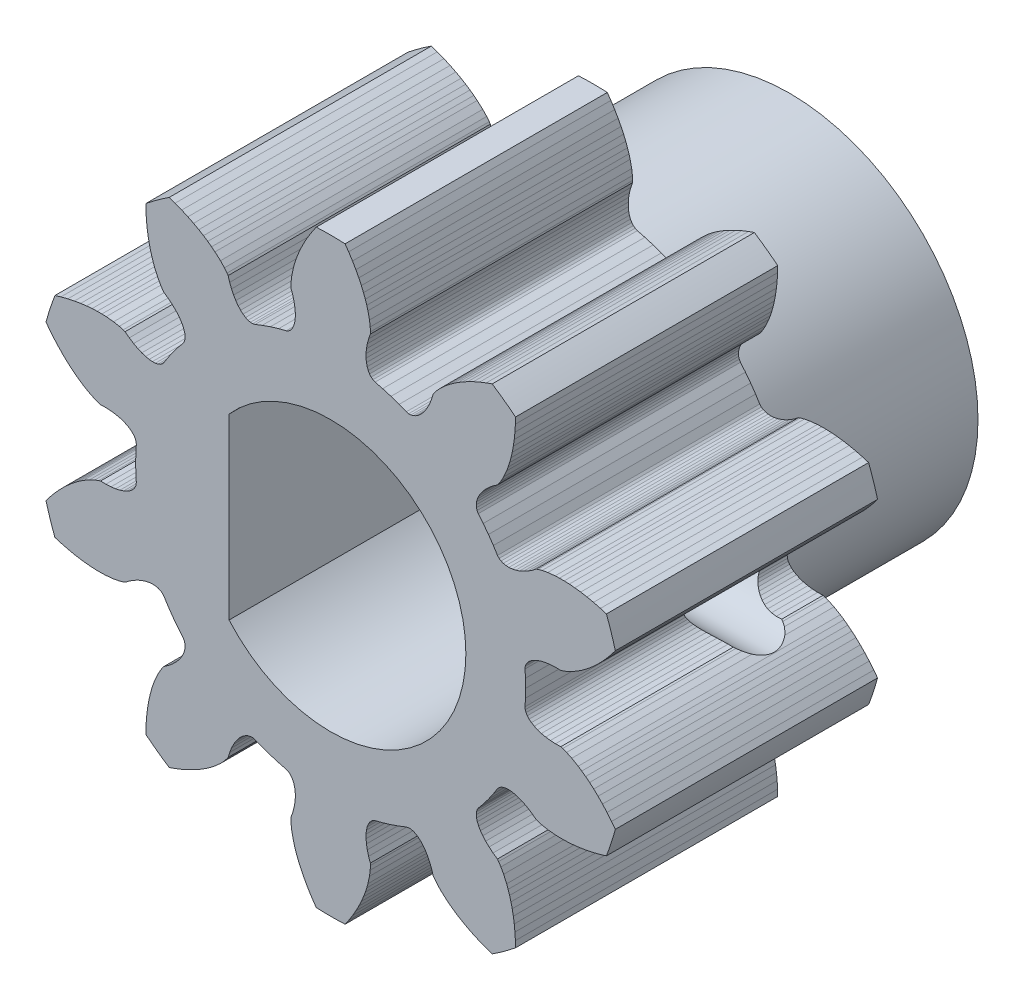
from build123d import *

# Parameters (mm, degrees)
ESTRUSIONE_ESTRUSIONE1_DEPTH  = 8
SCHIZZO3_R                    = 5.75
ESTRUSIONE_ESTRUSIONE2_DEPTH  = 6
TAGLIO_ESTRUSIONE1_DEPTH      = 101.078894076
TAGLIO_ESTRUSIONE2_DEPTH      = 17.849096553
TAGLIO_ESTRUSIONE2_DEPTH_BACK = 17.849096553
SCHIZZO5_R                    = 1.25


with BuildPart() as part:
    # Model → Estrusione-Estrusione1 (new body)
    with BuildSketch(Plane.XY):
        with BuildLine():
            Line((84.3642531, -6.8229085), (84.3776998, -6.6052075))
            Line((84.3776998, -6.6052075), (84.3989533, -6.4006846))
            Line((84.3989533, -6.4006846), (84.4270013, -6.2092224))
            Line((84.4270013, -6.2092224), (84.4608808, -6.0306182))
            Line((84.4608808, -6.0306182), (84.4990231, -5.8672724))
            Line((84.4990231, -5.8672724), (84.5406755, -5.7173835))
            Line((84.5406755, -5.7173835), (84.5852556, -5.5796565))
            Line((84.5852556, -5.5796565), (84.6311311, -5.4559447))
            Line((84.6311311, -5.4559447), (84.7223454, -5.2499237))
            Line((84.7223454, -5.2499237), (84.8060545, -5.0966229))
            Line((84.8060545, -5.0966229), (84.8758535, -4.9906464))
            Line((84.8758535, -4.9906464), (84.9126878, -4.9426861))
            Line((84.9126878, -4.9426861), (85.0452767, -4.8498404))
            Line((85.0452767, -4.8498404), (85.1666403, -4.7509355))
            Line((85.1666403, -4.7509355), (85.2711871, -4.6508992))
            Line((85.2711871, -4.6508992), (85.3590444, -4.5509615))
            Line((85.3590444, -4.5509615), (85.4304419, -4.4523401))
            Line((85.4304419, -4.4523401), (85.4856415, -4.3562291))
            Line((85.4856415, -4.3562291), (85.5250211, -4.2638123))
            Line((85.5250211, -4.2638123), (85.5489897, -4.1762141))
            Line((85.5489897, -4.1762141), (85.5580542, -4.0945743))
            Line((85.5580542, -4.0945743), (85.5527684, -4.0199615))
            Line((85.5527684, -4.0199615), (85.5337603, -3.9534272))
            Line((85.5337603, -3.9534272), (85.4968309, -3.8894812))
            Line((85.4968309, -3.8894812), (85.3459564, -3.7071016))
            Line((85.3459564, -3.7071016), (85.1863489, -3.4973223))
            Line((85.1863489, -3.4973223), (85.0361583, -3.2807011))
            Line((85.0361583, -3.2807011), (84.9093278, -3.0808525))
            Line((84.9093278, -3.0808525), (84.8599233, -3.0259701))
            Line((84.8599233, -3.0259701), (84.8025193, -2.9873322))
            Line((84.8025193, -2.9873322), (84.7331917, -2.9592484))
            Line((84.7331917, -2.9592484), (84.6527465, -2.9426412))
            Line((84.6527465, -2.9426412), (84.562029, -2.9383674))
            Line((84.562029, -2.9383674), (84.4619664, -2.9472613))
            Line((84.4619664, -2.9472613), (84.3535018, -2.9700592))
            Line((84.3535018, -2.9700592), (84.2376442, -3.0074866))
            Line((84.2376442, -3.0074866), (84.1154484, -3.0601615))
            Line((84.1154484, -3.0601615), (83.9880015, -3.1286785))
            Line((83.9880015, -3.1286785), (83.856434, -3.2135388))
            Line((83.856434, -3.2135388), (83.7271602, -3.3109474))
            Line((83.7271602, -3.3109474), (83.6701648, -3.3311584))
            Line((83.6701648, -3.3311584), (83.5478061, -3.3647926))
            Line((83.5478061, -3.3647926), (83.3761409, -3.3970321))
            Line((83.3761409, -3.3970321), (83.1520165, -3.4201181))
            Line((83.1520165, -3.4201181), (83.0201833, -3.4255193))
            Line((83.0201833, -3.4255193), (82.8754211, -3.4253575))
            Line((82.8754211, -3.4253575), (82.719997, -3.418653))
            Line((82.719997, -3.418653), (82.5528593, -3.4044519))
            Line((82.5528593, -3.4044519), (82.3725273, -3.3814815))
            Line((82.3725273, -3.3814815), (82.1817686, -3.3489916))
            Line((82.1817686, -3.3489916), (81.980688, -3.3060039))
            Line((81.980688, -3.3060039), (81.7694869, -3.2515191))
            Line((81.7694869, -3.2515191), (81.5868755, -3.1966214))
            ThreePointArc((81.5868755, -3.1966214), (81.440541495, -2.781136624), (81.3147124, -2.3589894))
            Line((81.3147124, -2.3589894), (81.43018, -2.20724))
            Line((81.43018, -2.20724), (81.56902, -2.03902))
            Line((81.56902, -2.03902), (81.70643, -1.88605))
            Line((81.70643, -1.88605), (81.84166, -1.74764))
            Line((81.84166, -1.74764), (81.97405, -1.62306))
            Line((81.97405, -1.62306), (82.10092, -1.51333))
            Line((82.10092, -1.51333), (82.22272, -1.41655))
            Line((82.22272, -1.41655), (82.33974, -1.33133))
            Line((82.33974, -1.33133), (82.44957, -1.25821))
            Line((82.44957, -1.25821), (82.64446, -1.14515))
            Line((82.64446, -1.14515), (82.80229, -1.07033))
            Line((82.80229, -1.07033), (82.92105, -1.02562))
            Line((82.92105, -1.02562), (82.97904, -1.00847))
            Line((82.97904, -1.00847), (83.14088, -1.01129))
            Line((83.14088, -1.01129), (83.2972, -1.00261))
            Line((83.2972, -1.00261), (83.44058, -0.98313))
            Line((83.44058, -0.98313), (83.5704, -0.95392))
            Line((83.5704, -0.95392), (83.68613, -0.9161))
            Line((83.68613, -0.9161), (83.78728, -0.87079))
            Line((83.78728, -0.87079), (83.87346, -0.81917))
            Line((83.87346, -0.81917), (83.94434, -0.76239))
            Line((83.94434, -0.76239), (83.99966, -0.70167))
            Line((83.99966, -0.70167), (84.03924, -0.6382))
            Line((84.03924, -0.6382), (84.06297, -0.5732))
            Line((84.06297, -0.5732), (84.07068, -0.49976))
            Line((84.07068, -0.49976), (84.05582, -0.26353))
            Line((84.05582, -0.26353), (84.05, 0))
            Line((84.05, 0), (84.05582, 0.26353))
            Line((84.05582, 0.26353), (84.07068, 0.49976))
            Line((84.07068, 0.49976), (84.06297, 0.5732))
            Line((84.06297, 0.5732), (84.03924, 0.6382))
            Line((84.03924, 0.6382), (83.99966, 0.70167))
            Line((83.99966, 0.70167), (83.94434, 0.76239))
            Line((83.94434, 0.76239), (83.87346, 0.81917))
            Line((83.87346, 0.81917), (83.78728, 0.87079))
            Line((83.78728, 0.87079), (83.68613, 0.9161))
            Line((83.68613, 0.9161), (83.5704, 0.95392))
            Line((83.5704, 0.95392), (83.44058, 0.98313))
            Line((83.44058, 0.98313), (83.2972, 1.00261))
            Line((83.2972, 1.00261), (83.14088, 1.01129))
            Line((83.14088, 1.01129), (82.97904, 1.00847))
            Line((82.97904, 1.00847), (82.92105, 1.02562))
            Line((82.92105, 1.02562), (82.80229, 1.07033))
            Line((82.80229, 1.07033), (82.64446, 1.14515))
            Line((82.64446, 1.14515), (82.44957, 1.25821))
            Line((82.44957, 1.25821), (82.33974, 1.33133))
            Line((82.33974, 1.33133), (82.22272, 1.41655))
            Line((82.22272, 1.41655), (82.10092, 1.51333))
            Line((82.10092, 1.51333), (81.97405, 1.62306))
            Line((81.97405, 1.62306), (81.84166, 1.74764))
            Line((81.84166, 1.74764), (81.70643, 1.88605))
            Line((81.70643, 1.88605), (81.56902, 2.03902))
            Line((81.56902, 2.03902), (81.43018, 2.20724))
            Line((81.43018, 2.20724), (81.3147124, 2.3589894))
            ThreePointArc((81.3147124, 2.3589894), (81.440541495, 2.781136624), (81.5868755, 3.1966214))
            Line((81.5868755, 3.1966214), (81.7694869, 3.2515191))
            Line((81.7694869, 3.2515191), (81.980688, 3.3060039))
            Line((81.980688, 3.3060039), (82.1817686, 3.3489916))
            Line((82.1817686, 3.3489916), (82.3725273, 3.3814815))
            Line((82.3725273, 3.3814815), (82.5528593, 3.4044519))
            Line((82.5528593, 3.4044519), (82.719997, 3.418653))
            Line((82.719997, 3.418653), (82.8754211, 3.4253575))
            Line((82.8754211, 3.4253575), (83.0201833, 3.4255193))
            Line((83.0201833, 3.4255193), (83.1520165, 3.4201181))
            Line((83.1520165, 3.4201181), (83.3761409, 3.3970321))
            Line((83.3761409, 3.3970321), (83.5478061, 3.3647926))
            Line((83.5478061, 3.3647926), (83.6701648, 3.3311584))
            Line((83.6701648, 3.3311584), (83.7271602, 3.3109474))
            Line((83.7271602, 3.3109474), (83.856434, 3.2135388))
            Line((83.856434, 3.2135388), (83.9880015, 3.1286785))
            Line((83.9880015, 3.1286785), (84.1154484, 3.0601615))
            Line((84.1154484, 3.0601615), (84.2376442, 3.0074866))
            Line((84.2376442, 3.0074866), (84.3535018, 2.9700592))
            Line((84.3535018, 2.9700592), (84.4619664, 2.9472613))
            Line((84.4619664, 2.9472613), (84.562029, 2.9383674))
            Line((84.562029, 2.9383674), (84.6527465, 2.9426412))
            Line((84.6527465, 2.9426412), (84.7331917, 2.9592484))
            Line((84.7331917, 2.9592484), (84.8025193, 2.9873322))
            Line((84.8025193, 2.9873322), (84.8599233, 3.0259701))
            Line((84.8599233, 3.0259701), (84.9093278, 3.0808525))
            Line((84.9093278, 3.0808525), (85.0361583, 3.2807011))
            Line((85.0361583, 3.2807011), (85.1863489, 3.4973223))
            Line((85.1863489, 3.4973223), (85.3459564, 3.7071016))
            Line((85.3459564, 3.7071016), (85.4968309, 3.8894812))
            Line((85.4968309, 3.8894812), (85.5337603, 3.9534272))
            Line((85.5337603, 3.9534272), (85.5527684, 4.0199615))
            Line((85.5527684, 4.0199615), (85.5580542, 4.0945743))
            Line((85.5580542, 4.0945743), (85.5489897, 4.1762141))
            Line((85.5489897, 4.1762141), (85.5250211, 4.2638123))
            Line((85.5250211, 4.2638123), (85.4856415, 4.3562291))
            Line((85.4856415, 4.3562291), (85.4304419, 4.4523401))
            Line((85.4304419, 4.4523401), (85.3590444, 4.5509615))
            Line((85.3590444, 4.5509615), (85.2711871, 4.6508992))
            Line((85.2711871, 4.6508992), (85.1666403, 4.7509355))
            Line((85.1666403, 4.7509355), (85.0452767, 4.8498404))
            Line((85.0452767, 4.8498404), (84.9126878, 4.9426861))
            Line((84.9126878, 4.9426861), (84.8758535, 4.9906464))
            Line((84.8758535, 4.9906464), (84.8060545, 5.0966229))
            Line((84.8060545, 5.0966229), (84.7223454, 5.2499237))
            Line((84.7223454, 5.2499237), (84.6311311, 5.4559447))
            Line((84.6311311, 5.4559447), (84.5852556, 5.5796565))
            Line((84.5852556, 5.5796565), (84.5406755, 5.7173835))
            Line((84.5406755, 5.7173835), (84.4990231, 5.8672724))
            Line((84.4990231, 5.8672724), (84.4608808, 6.0306182))
            Line((84.4608808, 6.0306182), (84.4270013, 6.2092224))
            Line((84.4270013, 6.2092224), (84.3989533, 6.4006846))
            Line((84.3989533, 6.4006846), (84.3776998, 6.6052075))
            Line((84.3776998, 6.6052075), (84.3642531, 6.8229085))
            Line((84.3642531, 6.8229085), (84.3600339, 7.0135465))
            ThreePointArc((84.3600339, 7.0135465), (84.709963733, 7.281110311), (85.0725663, 7.5312316))
            Line((85.0725663, 7.5312316), (85.25257, 7.4683085))
            Line((85.25257, 7.4683085), (85.4554606, 7.3882466))
            Line((85.4554606, 7.3882466), (85.6434058, 7.3048323))
            Line((85.6434058, 7.3048323), (85.8168299, 7.218992))
            Line((85.8168299, 7.218992), (85.9762233, 7.1315789))
            Line((85.9762233, 7.1315789), (86.1197877, 7.0448268))
            Line((86.1197877, 7.0448268), (86.2494692, 6.9588948))
            Line((86.2494692, 6.9588948), (86.3666794, 6.8739366))
            Line((86.3666794, 6.8739366), (86.47016, 6.7920774))
            Line((86.47016, 6.7920774), (86.6379108, 6.6416634))
            Line((86.6379108, 6.6416634), (86.757841, 6.5146788))
            Line((86.757841, 6.5146788), (86.8370616, 6.4155475))
            Line((86.8370616, 6.4155475), (86.8712921, 6.3656954))
            Line((86.8712921, 6.3656954), (86.9186214, 6.210905))
            Line((86.9186214, 6.210905), (86.9751821, 6.0649181))
            Line((86.9751821, 6.0649181), (87.0380156, 5.9345753))
            Line((87.0380156, 5.9345753), (87.1059125, 5.8201355))
            Line((87.1059125, 5.8201355), (87.177644, 5.7217567))
            Line((87.177644, 5.7217567), (87.2519934, 5.6395589))
            Line((87.2519934, 5.6395589), (87.3277181, 5.5735483))
            Line((87.3277181, 5.5735483), (87.4036222, 5.5236834))
            Line((87.4036222, 5.5236834), (87.4784651, 5.4898345))
            Line((87.4784651, 5.4898345), (87.5510596, 5.471805))
            Line((87.5510596, 5.471805), (87.6202112, 5.4693225))
            Line((87.6202112, 5.4693225), (87.6924394, 5.4846841))
            Line((87.6924394, 5.4846841), (87.9125154, 5.5718159))
            Line((87.9125154, 5.5718159), (88.1613489, 5.6587863))
            Line((88.1613489, 5.6587863), (88.4137793, 5.7346864))
            Line((88.4137793, 5.7346864), (88.6430394, 5.7935528))
            Line((88.6430394, 5.7935528), (88.7105024, 5.8235796))
            Line((88.7105024, 5.8235796), (88.7649881, 5.8662343))
            Line((88.7649881, 5.8662343), (88.8131208, 5.9234904))
            Line((88.8131208, 5.9234904), (88.8537741, 5.9948664))
            Line((88.8537741, 5.9948664), (88.885872, 6.0798232))
            Line((88.885872, 6.0798232), (88.9083344, 6.1777367))
            Line((88.9083344, 6.1777367), (88.9201697, 6.2879377))
            Line((88.9201697, 6.2879377), (88.9203762, 6.4096905))
            Line((88.9203762, 6.4096905), (88.9080399, 6.542183))
            Line((88.9080399, 6.542183), (88.8822597, 6.6845651))
            Line((88.8822597, 6.6845651), (88.8422093, 6.8359166))
            Line((88.8422093, 6.8359166), (88.789516, 6.9889641))
            Line((88.789516, 6.9889641), (88.7879067, 7.0494155))
            Line((88.7879067, 7.0494155), (88.7937296, 7.1761792))
            Line((88.7937296, 7.1761792), (88.8161155, 7.3494051))
            Line((88.8161155, 7.3494051), (88.8634176, 7.5696939))
            Line((88.8634176, 7.5696939), (88.8990196, 7.6967438))
            Line((88.8990196, 7.6967438), (88.9439074, 7.8343708))
            Line((88.9439074, 7.8343708), (88.9983124, 7.9801162))
            Line((88.9983124, 7.9801162), (89.0634668, 8.1346852))
            Line((89.0634668, 8.1346852), (89.1410387, 8.2990929))
            Line((89.1410387, 8.2990929), (89.2308861, 8.4704753))
            Line((89.2308861, 8.4704753), (89.3339072, 8.6484303))
            Line((89.3339072, 8.6484303), (89.45099, 8.8324578))
            Line((89.45099, 8.8324578), (89.5596308, 8.9891672))
            ThreePointArc((89.5596308, 8.9891672), (90, 8.999947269), (90.4403692, 8.9891672))
            Line((90.4403692, 8.9891672), (90.54901, 8.8324578))
            Line((90.54901, 8.8324578), (90.6660928, 8.6484303))
            Line((90.6660928, 8.6484303), (90.7691139, 8.4704753))
            Line((90.7691139, 8.4704753), (90.8589613, 8.2990929))
            Line((90.8589613, 8.2990929), (90.9365332, 8.1346852))
            Line((90.9365332, 8.1346852), (91.0016876, 7.9801162))
            Line((91.0016876, 7.9801162), (91.0560926, 7.8343708))
            Line((91.0560926, 7.8343708), (91.1009804, 7.6967438))
            Line((91.1009804, 7.6967438), (91.1365824, 7.5696939))
            Line((91.1365824, 7.5696939), (91.1838845, 7.3494051))
            Line((91.1838845, 7.3494051), (91.2062704, 7.1761792))
            Line((91.2062704, 7.1761792), (91.2120933, 7.0494155))
            Line((91.2120933, 7.0494155), (91.210484, 6.9889641))
            Line((91.210484, 6.9889641), (91.1577907, 6.8359166))
            Line((91.1577907, 6.8359166), (91.1177403, 6.6845651))
            Line((91.1177403, 6.6845651), (91.0919601, 6.542183))
            Line((91.0919601, 6.542183), (91.0796238, 6.4096905))
            Line((91.0796238, 6.4096905), (91.0798303, 6.2879377))
            Line((91.0798303, 6.2879377), (91.0916656, 6.1777367))
            Line((91.0916656, 6.1777367), (91.114128, 6.0798232))
            Line((91.114128, 6.0798232), (91.1462259, 5.9948664))
            Line((91.1462259, 5.9948664), (91.1868792, 5.9234904))
            Line((91.1868792, 5.9234904), (91.2350119, 5.8662343))
            Line((91.2350119, 5.8662343), (91.2894976, 5.8235796))
            Line((91.2894976, 5.8235796), (91.3569606, 5.7935528))
            Line((91.3569606, 5.7935528), (91.5862207, 5.7346864))
            Line((91.5862207, 5.7346864), (91.8386511, 5.6587863))
            Line((91.8386511, 5.6587863), (92.0874846, 5.5718159))
            Line((92.0874846, 5.5718159), (92.3075606, 5.4846841))
            Line((92.3075606, 5.4846841), (92.3797888, 5.4693225))
            Line((92.3797888, 5.4693225), (92.4489404, 5.471805))
            Line((92.4489404, 5.471805), (92.5215349, 5.4898345))
            Line((92.5215349, 5.4898345), (92.5963778, 5.5236834))
            Line((92.5963778, 5.5236834), (92.6722819, 5.5735483))
            Line((92.6722819, 5.5735483), (92.7480066, 5.6395589))
            Line((92.7480066, 5.6395589), (92.822356, 5.7217567))
            Line((92.822356, 5.7217567), (92.8940875, 5.8201355))
            Line((92.8940875, 5.8201355), (92.9619844, 5.9345753))
            Line((92.9619844, 5.9345753), (93.0248179, 6.0649181))
            Line((93.0248179, 6.0649181), (93.0813786, 6.210905))
            Line((93.0813786, 6.210905), (93.1287079, 6.3656954))
            Line((93.1287079, 6.3656954), (93.1629384, 6.4155475))
            Line((93.1629384, 6.4155475), (93.242159, 6.5146788))
            Line((93.242159, 6.5146788), (93.3620892, 6.6416634))
            Line((93.3620892, 6.6416634), (93.52984, 6.7920774))
            Line((93.52984, 6.7920774), (93.6333206, 6.8739366))
            Line((93.6333206, 6.8739366), (93.7505308, 6.9588948))
            Line((93.7505308, 6.9588948), (93.8802123, 7.0448268))
            Line((93.8802123, 7.0448268), (94.0237767, 7.1315789))
            Line((94.0237767, 7.1315789), (94.1831701, 7.218992))
            Line((94.1831701, 7.218992), (94.3565942, 7.3048323))
            Line((94.3565942, 7.3048323), (94.5445394, 7.3882466))
            Line((94.5445394, 7.3882466), (94.74743, 7.4683085))
            Line((94.74743, 7.4683085), (94.9274337, 7.5312316))
            ThreePointArc((94.9274337, 7.5312316), (95.290036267, 7.281110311), (95.6399661, 7.0135465))
            Line((95.6399661, 7.0135465), (95.6357469, 6.8229085))
            Line((95.6357469, 6.8229085), (95.6223002, 6.6052075))
            Line((95.6223002, 6.6052075), (95.6010467, 6.4006846))
            Line((95.6010467, 6.4006846), (95.5729987, 6.2092224))
            Line((95.5729987, 6.2092224), (95.5391192, 6.0306182))
            Line((95.5391192, 6.0306182), (95.5009769, 5.8672724))
            Line((95.5009769, 5.8672724), (95.4593245, 5.7173835))
            Line((95.4593245, 5.7173835), (95.4147444, 5.5796565))
            Line((95.4147444, 5.5796565), (95.3688689, 5.4559447))
            Line((95.3688689, 5.4559447), (95.2776546, 5.2499237))
            Line((95.2776546, 5.2499237), (95.1939455, 5.0966229))
            Line((95.1939455, 5.0966229), (95.1241465, 4.9906464))
            Line((95.1241465, 4.9906464), (95.0873122, 4.9426861))
            Line((95.0873122, 4.9426861), (94.9547233, 4.8498404))
            Line((94.9547233, 4.8498404), (94.8333597, 4.7509355))
            Line((94.8333597, 4.7509355), (94.7288129, 4.6508992))
            Line((94.7288129, 4.6508992), (94.6409556, 4.5509615))
            Line((94.6409556, 4.5509615), (94.5695581, 4.4523401))
            Line((94.5695581, 4.4523401), (94.5143585, 4.3562291))
            Line((94.5143585, 4.3562291), (94.4749789, 4.2638123))
            Line((94.4749789, 4.2638123), (94.4510103, 4.1762141))
            Line((94.4510103, 4.1762141), (94.4419458, 4.0945743))
            Line((94.4419458, 4.0945743), (94.4472316, 4.0199615))
            Line((94.4472316, 4.0199615), (94.4662397, 3.9534272))
            Line((94.4662397, 3.9534272), (94.5031691, 3.8894812))
            Line((94.5031691, 3.8894812), (94.6540436, 3.7071016))
            Line((94.6540436, 3.7071016), (94.8136511, 3.4973223))
            Line((94.8136511, 3.4973223), (94.9638417, 3.2807011))
            Line((94.9638417, 3.2807011), (95.0906722, 3.0808525))
            Line((95.0906722, 3.0808525), (95.1400767, 3.0259701))
            Line((95.1400767, 3.0259701), (95.1974807, 2.9873322))
            Line((95.1974807, 2.9873322), (95.2668083, 2.9592484))
            Line((95.2668083, 2.9592484), (95.3472535, 2.9426412))
            Line((95.3472535, 2.9426412), (95.437971, 2.9383674))
            Line((95.437971, 2.9383674), (95.5380336, 2.9472613))
            Line((95.5380336, 2.9472613), (95.6464982, 2.9700592))
            Line((95.6464982, 2.9700592), (95.7623558, 3.0074866))
            Line((95.7623558, 3.0074866), (95.8845516, 3.0601615))
            Line((95.8845516, 3.0601615), (96.0119985, 3.1286785))
            Line((96.0119985, 3.1286785), (96.143566, 3.2135388))
            Line((96.143566, 3.2135388), (96.2728398, 3.3109474))
            Line((96.2728398, 3.3109474), (96.3298352, 3.3311584))
            Line((96.3298352, 3.3311584), (96.4521939, 3.3647926))
            Line((96.4521939, 3.3647926), (96.6238591, 3.3970321))
            Line((96.6238591, 3.3970321), (96.8479835, 3.4201181))
            Line((96.8479835, 3.4201181), (96.9798167, 3.4255193))
            Line((96.9798167, 3.4255193), (97.1245789, 3.4253575))
            Line((97.1245789, 3.4253575), (97.280003, 3.418653))
            Line((97.280003, 3.418653), (97.4471407, 3.4044519))
            Line((97.4471407, 3.4044519), (97.6274727, 3.3814815))
            Line((97.6274727, 3.3814815), (97.8182314, 3.3489916))
            Line((97.8182314, 3.3489916), (98.019312, 3.3060039))
            Line((98.019312, 3.3060039), (98.2305131, 3.2515191))
            Line((98.2305131, 3.2515191), (98.4131245, 3.1966214))
            ThreePointArc((98.4131245, 3.1966214), (98.559458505, 2.781136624), (98.6852876, 2.3589894))
            Line((98.6852876, 2.3589894), (98.56982, 2.20724))
            Line((98.56982, 2.20724), (98.43098, 2.03902))
            Line((98.43098, 2.03902), (98.29357, 1.88605))
            Line((98.29357, 1.88605), (98.15834, 1.74764))
            Line((98.15834, 1.74764), (98.02595, 1.62306))
            Line((98.02595, 1.62306), (97.89908, 1.51333))
            Line((97.89908, 1.51333), (97.77728, 1.41655))
            Line((97.77728, 1.41655), (97.66026, 1.33133))
            Line((97.66026, 1.33133), (97.55043, 1.25821))
            Line((97.55043, 1.25821), (97.35554, 1.14515))
            Line((97.35554, 1.14515), (97.19771, 1.07033))
            Line((97.19771, 1.07033), (97.07895, 1.02562))
            Line((97.07895, 1.02562), (97.02096, 1.00847))
            Line((97.02096, 1.00847), (96.85912, 1.01129))
            Line((96.85912, 1.01129), (96.7028, 1.00261))
            Line((96.7028, 1.00261), (96.55942, 0.98313))
            Line((96.55942, 0.98313), (96.4296, 0.95392))
            Line((96.4296, 0.95392), (96.31387, 0.9161))
            Line((96.31387, 0.9161), (96.21272, 0.87079))
            Line((96.21272, 0.87079), (96.12654, 0.81917))
            Line((96.12654, 0.81917), (96.05566, 0.76239))
            Line((96.05566, 0.76239), (96.00034, 0.70167))
            Line((96.00034, 0.70167), (95.96076, 0.6382))
            Line((95.96076, 0.6382), (95.93703, 0.5732))
            Line((95.93703, 0.5732), (95.92932, 0.49976))
            Line((95.92932, 0.49976), (95.94418, 0.26353))
            Line((95.94418, 0.26353), (95.95, 0))
            Line((95.95, 0), (95.94418, -0.26353))
            Line((95.94418, -0.26353), (95.92932, -0.49976))
            Line((95.92932, -0.49976), (95.93703, -0.5732))
            Line((95.93703, -0.5732), (95.96076, -0.6382))
            Line((95.96076, -0.6382), (96.00034, -0.70167))
            Line((96.00034, -0.70167), (96.05566, -0.76239))
            Line((96.05566, -0.76239), (96.12654, -0.81917))
            Line((96.12654, -0.81917), (96.21272, -0.87079))
            Line((96.21272, -0.87079), (96.31387, -0.9161))
            Line((96.31387, -0.9161), (96.4296, -0.95392))
            Line((96.4296, -0.95392), (96.55942, -0.98313))
            Line((96.55942, -0.98313), (96.7028, -1.00261))
            Line((96.7028, -1.00261), (96.85912, -1.01129))
            Line((96.85912, -1.01129), (97.02096, -1.00847))
            Line((97.02096, -1.00847), (97.07895, -1.02562))
            Line((97.07895, -1.02562), (97.19771, -1.07033))
            Line((97.19771, -1.07033), (97.35554, -1.14515))
            Line((97.35554, -1.14515), (97.55043, -1.25821))
            Line((97.55043, -1.25821), (97.66026, -1.33133))
            Line((97.66026, -1.33133), (97.77728, -1.41655))
            Line((97.77728, -1.41655), (97.89908, -1.51333))
            Line((97.89908, -1.51333), (98.02595, -1.62306))
            Line((98.02595, -1.62306), (98.15834, -1.74764))
            Line((98.15834, -1.74764), (98.29357, -1.88605))
            Line((98.29357, -1.88605), (98.43098, -2.03902))
            Line((98.43098, -2.03902), (98.56982, -2.20724))
            Line((98.56982, -2.20724), (98.6852876, -2.3589894))
            ThreePointArc((98.6852876, -2.3589894), (98.559458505, -2.781136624), (98.4131245, -3.1966214))
            Line((98.4131245, -3.1966214), (98.2305131, -3.2515191))
            Line((98.2305131, -3.2515191), (98.019312, -3.3060039))
            Line((98.019312, -3.3060039), (97.8182314, -3.3489916))
            Line((97.8182314, -3.3489916), (97.6274727, -3.3814815))
            Line((97.6274727, -3.3814815), (97.4471407, -3.4044519))
            Line((97.4471407, -3.4044519), (97.280003, -3.418653))
            Line((97.280003, -3.418653), (97.1245789, -3.4253575))
            Line((97.1245789, -3.4253575), (96.9798167, -3.4255193))
            Line((96.9798167, -3.4255193), (96.8479835, -3.4201181))
            Line((96.8479835, -3.4201181), (96.6238591, -3.3970321))
            Line((96.6238591, -3.3970321), (96.4521939, -3.3647926))
            Line((96.4521939, -3.3647926), (96.3298352, -3.3311584))
            Line((96.3298352, -3.3311584), (96.2728398, -3.3109474))
            Line((96.2728398, -3.3109474), (96.143566, -3.2135388))
            Line((96.143566, -3.2135388), (96.0119985, -3.1286785))
            Line((96.0119985, -3.1286785), (95.8845516, -3.0601615))
            Line((95.8845516, -3.0601615), (95.7623558, -3.0074866))
            Line((95.7623558, -3.0074866), (95.6464982, -2.9700592))
            Line((95.6464982, -2.9700592), (95.5380336, -2.9472613))
            Line((95.5380336, -2.9472613), (95.437971, -2.9383674))
            Line((95.437971, -2.9383674), (95.3472535, -2.9426412))
            Line((95.3472535, -2.9426412), (95.2668083, -2.9592484))
            Line((95.2668083, -2.9592484), (95.1974807, -2.9873322))
            Line((95.1974807, -2.9873322), (95.1400767, -3.0259701))
            Line((95.1400767, -3.0259701), (95.0906722, -3.0808525))
            Line((95.0906722, -3.0808525), (94.9638417, -3.2807011))
            Line((94.9638417, -3.2807011), (94.8136511, -3.4973223))
            Line((94.8136511, -3.4973223), (94.6540436, -3.7071016))
            Line((94.6540436, -3.7071016), (94.5031691, -3.8894812))
            Line((94.5031691, -3.8894812), (94.4662397, -3.9534272))
            Line((94.4662397, -3.9534272), (94.4472316, -4.0199615))
            Line((94.4472316, -4.0199615), (94.4419458, -4.0945743))
            Line((94.4419458, -4.0945743), (94.4510103, -4.1762141))
            Line((94.4510103, -4.1762141), (94.4749789, -4.2638123))
            Line((94.4749789, -4.2638123), (94.5143585, -4.3562291))
            Line((94.5143585, -4.3562291), (94.5695581, -4.4523401))
            Line((94.5695581, -4.4523401), (94.6409556, -4.5509615))
            Line((94.6409556, -4.5509615), (94.7288129, -4.6508992))
            Line((94.7288129, -4.6508992), (94.8333597, -4.7509355))
            Line((94.8333597, -4.7509355), (94.9547233, -4.8498404))
            Line((94.9547233, -4.8498404), (95.0873122, -4.9426861))
            Line((95.0873122, -4.9426861), (95.1241465, -4.9906464))
            Line((95.1241465, -4.9906464), (95.1939455, -5.0966229))
            Line((95.1939455, -5.0966229), (95.2776546, -5.2499237))
            Line((95.2776546, -5.2499237), (95.3688689, -5.4559447))
            Line((95.3688689, -5.4559447), (95.4147444, -5.5796565))
            Line((95.4147444, -5.5796565), (95.4593245, -5.7173835))
            Line((95.4593245, -5.7173835), (95.5009769, -5.8672724))
            Line((95.5009769, -5.8672724), (95.5391192, -6.0306182))
            Line((95.5391192, -6.0306182), (95.5729987, -6.2092224))
            Line((95.5729987, -6.2092224), (95.6010467, -6.4006846))
            Line((95.6010467, -6.4006846), (95.6223002, -6.6052075))
            Line((95.6223002, -6.6052075), (95.6357469, -6.8229085))
            Line((95.6357469, -6.8229085), (95.6399661, -7.0135465))
            ThreePointArc((95.6399661, -7.0135465), (95.290036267, -7.281110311), (94.9274337, -7.5312316))
            Line((94.9274337, -7.5312316), (94.74743, -7.4683085))
            Line((94.74743, -7.4683085), (94.5445394, -7.3882466))
            Line((94.5445394, -7.3882466), (94.3565942, -7.3048323))
            Line((94.3565942, -7.3048323), (94.1831701, -7.218992))
            Line((94.1831701, -7.218992), (94.0237767, -7.1315789))
            Line((94.0237767, -7.1315789), (93.8802123, -7.0448268))
            Line((93.8802123, -7.0448268), (93.7505308, -6.9588948))
            Line((93.7505308, -6.9588948), (93.6333206, -6.8739366))
            Line((93.6333206, -6.8739366), (93.52984, -6.7920774))
            Line((93.52984, -6.7920774), (93.3620892, -6.6416634))
            Line((93.3620892, -6.6416634), (93.242159, -6.5146788))
            Line((93.242159, -6.5146788), (93.1629384, -6.4155475))
            Line((93.1629384, -6.4155475), (93.1287079, -6.3656954))
            Line((93.1287079, -6.3656954), (93.0813786, -6.210905))
            Line((93.0813786, -6.210905), (93.0248179, -6.0649181))
            Line((93.0248179, -6.0649181), (92.9619844, -5.9345753))
            Line((92.9619844, -5.9345753), (92.8940875, -5.8201355))
            Line((92.8940875, -5.8201355), (92.822356, -5.7217567))
            Line((92.822356, -5.7217567), (92.7480066, -5.6395589))
            Line((92.7480066, -5.6395589), (92.6722819, -5.5735483))
            Line((92.6722819, -5.5735483), (92.5963778, -5.5236834))
            Line((92.5963778, -5.5236834), (92.5215349, -5.4898345))
            Line((92.5215349, -5.4898345), (92.4489404, -5.471805))
            Line((92.4489404, -5.471805), (92.3797888, -5.4693225))
            Line((92.3797888, -5.4693225), (92.3075606, -5.4846841))
            Line((92.3075606, -5.4846841), (92.0874846, -5.5718159))
            Line((92.0874846, -5.5718159), (91.8386511, -5.6587863))
            Line((91.8386511, -5.6587863), (91.5862207, -5.7346864))
            Line((91.5862207, -5.7346864), (91.3569606, -5.7935528))
            Line((91.3569606, -5.7935528), (91.2894976, -5.8235796))
            Line((91.2894976, -5.8235796), (91.2350119, -5.8662343))
            Line((91.2350119, -5.8662343), (91.1868792, -5.9234904))
            Line((91.1868792, -5.9234904), (91.1462259, -5.9948664))
            Line((91.1462259, -5.9948664), (91.114128, -6.0798232))
            Line((91.114128, -6.0798232), (91.0916656, -6.1777367))
            Line((91.0916656, -6.1777367), (91.0798303, -6.2879377))
            Line((91.0798303, -6.2879377), (91.0796238, -6.4096905))
            Line((91.0796238, -6.4096905), (91.0919601, -6.542183))
            Line((91.0919601, -6.542183), (91.1177403, -6.6845651))
            Line((91.1177403, -6.6845651), (91.1577907, -6.8359166))
            Line((91.1577907, -6.8359166), (91.210484, -6.9889641))
            Line((91.210484, -6.9889641), (91.2120933, -7.0494155))
            Line((91.2120933, -7.0494155), (91.2062704, -7.1761792))
            Line((91.2062704, -7.1761792), (91.1838845, -7.3494051))
            Line((91.1838845, -7.3494051), (91.1365824, -7.5696939))
            Line((91.1365824, -7.5696939), (91.1009804, -7.6967438))
            Line((91.1009804, -7.6967438), (91.0560926, -7.8343708))
            Line((91.0560926, -7.8343708), (91.0016876, -7.9801162))
            Line((91.0016876, -7.9801162), (90.9365332, -8.1346852))
            Line((90.9365332, -8.1346852), (90.8589613, -8.2990929))
            Line((90.8589613, -8.2990929), (90.7691139, -8.4704753))
            Line((90.7691139, -8.4704753), (90.6660928, -8.6484303))
            Line((90.6660928, -8.6484303), (90.54901, -8.8324578))
            Line((90.54901, -8.8324578), (90.4403692, -8.9891672))
            ThreePointArc((90.4403692, -8.9891672), (90, -8.999947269), (89.5596308, -8.9891672))
            Line((89.5596308, -8.9891672), (89.45099, -8.8324578))
            Line((89.45099, -8.8324578), (89.3339072, -8.6484303))
            Line((89.3339072, -8.6484303), (89.2308861, -8.4704753))
            Line((89.2308861, -8.4704753), (89.1410387, -8.2990929))
            Line((89.1410387, -8.2990929), (89.0634668, -8.1346852))
            Line((89.0634668, -8.1346852), (88.9983124, -7.9801162))
            Line((88.9983124, -7.9801162), (88.9439074, -7.8343708))
            Line((88.9439074, -7.8343708), (88.8990196, -7.6967438))
            Line((88.8990196, -7.6967438), (88.8634176, -7.5696939))
            Line((88.8634176, -7.5696939), (88.8161155, -7.3494051))
            Line((88.8161155, -7.3494051), (88.7937296, -7.1761792))
            Line((88.7937296, -7.1761792), (88.7879067, -7.0494155))
            Line((88.7879067, -7.0494155), (88.789516, -6.9889641))
            Line((88.789516, -6.9889641), (88.8422093, -6.8359166))
            Line((88.8422093, -6.8359166), (88.8822597, -6.6845651))
            Line((88.8822597, -6.6845651), (88.9080399, -6.542183))
            Line((88.9080399, -6.542183), (88.9203762, -6.4096905))
            Line((88.9203762, -6.4096905), (88.9201697, -6.2879377))
            Line((88.9201697, -6.2879377), (88.9083344, -6.1777367))
            Line((88.9083344, -6.1777367), (88.885872, -6.0798232))
            Line((88.885872, -6.0798232), (88.8537741, -5.9948664))
            Line((88.8537741, -5.9948664), (88.8131208, -5.9234904))
            Line((88.8131208, -5.9234904), (88.7649881, -5.8662343))
            Line((88.7649881, -5.8662343), (88.7105024, -5.8235796))
            Line((88.7105024, -5.8235796), (88.6430394, -5.7935528))
            Line((88.6430394, -5.7935528), (88.4137793, -5.7346864))
            Line((88.4137793, -5.7346864), (88.1613489, -5.6587863))
            Line((88.1613489, -5.6587863), (87.9125154, -5.5718159))
            Line((87.9125154, -5.5718159), (87.6924394, -5.4846841))
            Line((87.6924394, -5.4846841), (87.6202112, -5.4693225))
            Line((87.6202112, -5.4693225), (87.5510596, -5.471805))
            Line((87.5510596, -5.471805), (87.4784651, -5.4898345))
            Line((87.4784651, -5.4898345), (87.4036222, -5.5236834))
            Line((87.4036222, -5.5236834), (87.3277181, -5.5735483))
            Line((87.3277181, -5.5735483), (87.2519934, -5.6395589))
            Line((87.2519934, -5.6395589), (87.177644, -5.7217567))
            Line((87.177644, -5.7217567), (87.1059125, -5.8201355))
            Line((87.1059125, -5.8201355), (87.0380156, -5.9345753))
            Line((87.0380156, -5.9345753), (86.9751821, -6.0649181))
            Line((86.9751821, -6.0649181), (86.9186214, -6.210905))
            Line((86.9186214, -6.210905), (86.8712921, -6.3656954))
            Line((86.8712921, -6.3656954), (86.8370616, -6.4155475))
            Line((86.8370616, -6.4155475), (86.757841, -6.5146788))
            Line((86.757841, -6.5146788), (86.6379108, -6.6416634))
            Line((86.6379108, -6.6416634), (86.47016, -6.7920774))
            Line((86.47016, -6.7920774), (86.3666794, -6.8739366))
            Line((86.3666794, -6.8739366), (86.2494692, -6.9588948))
            Line((86.2494692, -6.9588948), (86.1197877, -7.0448268))
            Line((86.1197877, -7.0448268), (85.9762233, -7.1315789))
            Line((85.9762233, -7.1315789), (85.8168299, -7.218992))
            Line((85.8168299, -7.218992), (85.6434058, -7.3048323))
            Line((85.6434058, -7.3048323), (85.4554606, -7.3882466))
            Line((85.4554606, -7.3882466), (85.25257, -7.4683085))
            Line((85.25257, -7.4683085), (85.0725663, -7.5312316))
            ThreePointArc((85.0725663, -7.5312316), (84.709963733, -7.281110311), (84.3600339, -7.0135465))
            Line((84.3600339, -7.0135465), (84.3642531, -6.8229085))
        make_face()
    extrude(amount=ESTRUSIONE_ESTRUSIONE1_DEPTH)

    # Schizzo3 → Estrusione-Estrusione2 (add)
    with BuildSketch(Plane(origin=(0, 0, 0), x_dir=(-1, 0, 0), z_dir=(0, 0, -1))):
        with Locations(Location((-90, 0, 0), (0, 0, 180))):
            Circle(SCHIZZO3_R)
    extrude(amount=ESTRUSIONE_ESTRUSIONE2_DEPTH)

    # Schizzo4 → Taglio-Estrusione1 (cut, through all)
    with BuildSketch(Plane(origin=(0, 0, -6), x_dir=(-1, 0, 0), z_dir=(0, 0, -1))):
        with BuildLine():
            Line((-86.9, 2.721327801), (-86.9, -2.721327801))
            ThreePointArc((-86.9, -2.721327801), (-94.125, 0), (-86.9, 2.721327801))
        make_face()
    extrude(amount=-TAGLIO_ESTRUSIONE1_DEPTH, mode=Mode.SUBTRACT)

    # Schizzo5 → Taglio-Estrusione2 (cut, two sides: drawn at the far end of the back side and taken through both)
    with BuildSketch(Plane(origin=(86.9, 0, 0), x_dir=(0, 0, -1), z_dir=(1, 0, 0)).offset(-TAGLIO_ESTRUSIONE2_DEPTH_BACK)):
        with Locations(Location((-2, 0, 0), (0, 0, 180))):
            Circle(SCHIZZO5_R)
    extrude(amount=TAGLIO_ESTRUSIONE2_DEPTH + TAGLIO_ESTRUSIONE2_DEPTH_BACK, mode=Mode.SUBTRACT)


solid = part.part
